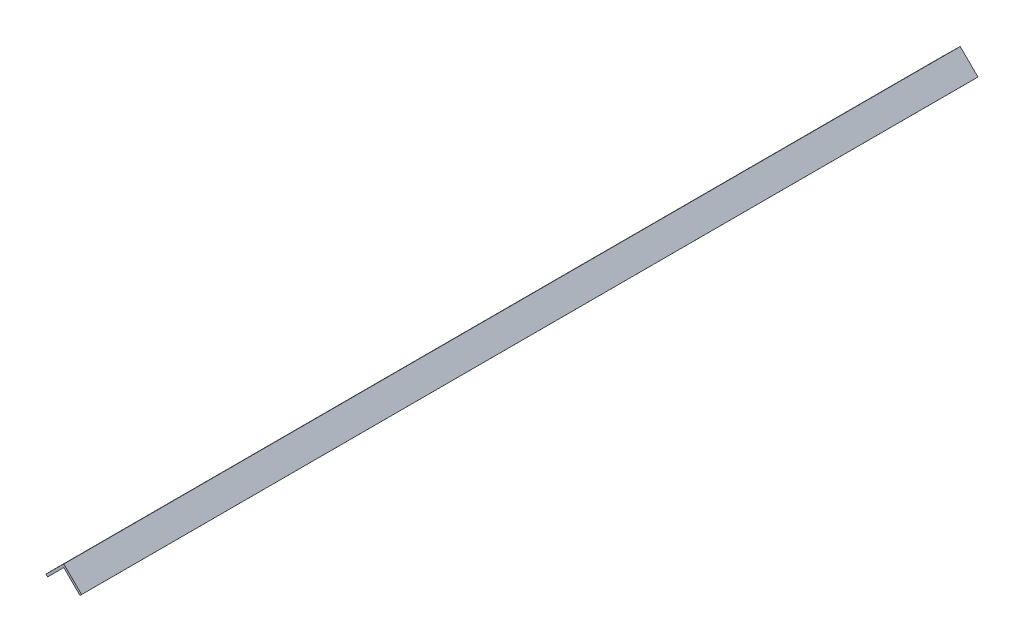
from build123d import *

# Parameters (mm, degrees)
BOSS_EXTRUDE1_DEPTH = 2260


with BuildPart() as part:
    # Sketch2 → Boss-Extrude1 (new body)
    with BuildSketch(Plane.XY):
        Polygon((-40.668809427, 0), (0, 40.668809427), (40.668809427, 0), (44.879605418, 4.274248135), (0, 48.487606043), (-44.879605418, 4.274248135), align=None)
    extrude(amount=BOSS_EXTRUDE1_DEPTH)


solid = part.part
